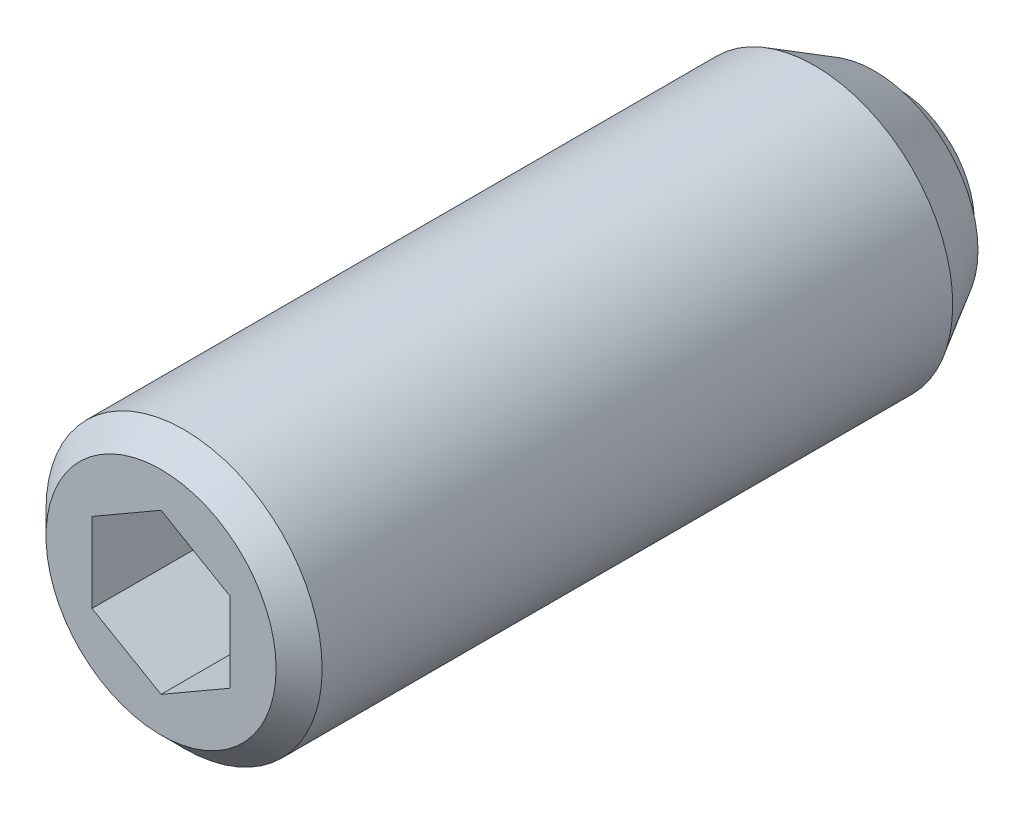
ISO-10303-21;
HEADER;
FILE_DESCRIPTION(('STEP AP214'),'2;1');
FILE_NAME('part.step','',(''),(''),'','','');
FILE_SCHEMA(('AUTOMOTIVE_DESIGN { 1 0 10303 214 1 1 1 1 }'));
ENDSEC;
DATA;
#1=APPLICATION_CONTEXT('core data for automotive mechanical design processes');
#2=APPLICATION_PROTOCOL_DEFINITION('international standard','automotive_design',2000,#1);
#3=PRODUCT_CONTEXT('',#1,'mechanical');
#4=PRODUCT('Part','Part','',(#3));
#5=PRODUCT_RELATED_PRODUCT_CATEGORY('part','',(#4));
#6=PRODUCT_DEFINITION_FORMATION('','',#4);
#7=PRODUCT_DEFINITION_CONTEXT('part definition',#1,'design');
#8=PRODUCT_DEFINITION('design','',#6,#7);
#9=PRODUCT_DEFINITION_SHAPE('','',#8);
#10=(LENGTH_UNIT() NAMED_UNIT(*) SI_UNIT(.MILLI.,.METRE.));
#11=(NAMED_UNIT(*) PLANE_ANGLE_UNIT() SI_UNIT($,.RADIAN.));
#12=(NAMED_UNIT(*) SI_UNIT($,.STERADIAN.) SOLID_ANGLE_UNIT());
#13=UNCERTAINTY_MEASURE_WITH_UNIT(LENGTH_MEASURE(1.E-05),#10,'distance_accuracy_value','');
#14=(GEOMETRIC_REPRESENTATION_CONTEXT(3) GLOBAL_UNCERTAINTY_ASSIGNED_CONTEXT((#13)) GLOBAL_UNIT_ASSIGNED_CONTEXT((#10,
#11,#12)) REPRESENTATION_CONTEXT('',''));
#15=CARTESIAN_POINT('',(0.,0.,0.));
#16=DIRECTION('',(0.,0.,1.));
#17=DIRECTION('',(1.,0.,0.));
#18=AXIS2_PLACEMENT_3D('',#15,#16,#17);
#19=CARTESIAN_POINT('',(1.5,0.866025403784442,13.5));
#20=DIRECTION('',(0.5,0.86602540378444,0.));
#21=DIRECTION('',(0.86602540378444,-0.5,0.));
#22=AXIS2_PLACEMENT_3D('',#19,#20,#21);
#23=PLANE('',#22);
#24=DIRECTION('',(0.,0.,1.));
#25=VECTOR('',#24,1.);
#26=CARTESIAN_POINT('',(1.5,0.866025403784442,13.5));
#27=LINE('',#26,#25);
#28=CARTESIAN_POINT('',(1.5,0.866025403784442,13.));
#29=VERTEX_POINT('',#28);
#30=CARTESIAN_POINT('',(1.5,0.866025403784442,16.));
#31=VERTEX_POINT('',#30);
#32=EDGE_CURVE('E68',#29,#31,#27,.T.);
#33=ORIENTED_EDGE('',*,*,#32,.T.);
#34=DIRECTION('',(-0.86602540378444,0.5,0.));
#35=VECTOR('',#34,1.);
#36=CARTESIAN_POINT('',(1.5,0.866025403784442,16.));
#37=LINE('',#36,#35);
#38=CARTESIAN_POINT('',(0.,1.73205080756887,16.));
#39=VERTEX_POINT('',#38);
#40=EDGE_CURVE('E29',#31,#39,#37,.T.);
#41=ORIENTED_EDGE('',*,*,#40,.T.);
#42=DIRECTION('',(0.,0.,1.));
#43=VECTOR('',#42,1.);
#44=CARTESIAN_POINT('',(0.,1.73205080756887,13.5));
#45=LINE('',#44,#43);
#46=CARTESIAN_POINT('',(0.,1.73205080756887,13.));
#47=VERTEX_POINT('',#46);
#48=EDGE_CURVE('E80',#47,#39,#45,.T.);
#49=ORIENTED_EDGE('',*,*,#48,.F.);
#50=DIRECTION('',(-0.86602540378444,0.5,0.));
#51=VECTOR('',#50,1.);
#52=CARTESIAN_POINT('',(1.5,0.866025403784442,13.));
#53=LINE('',#52,#51);
#54=EDGE_CURVE('E79',#29,#47,#53,.T.);
#55=ORIENTED_EDGE('',*,*,#54,.F.);
#56=EDGE_LOOP('',(#33,#41,#49,#55));
#57=FACE_BOUND('',#56,.T.);
#58=ADVANCED_FACE('F14',(#57),#23,.F.);
#59=CARTESIAN_POINT('',(1.5,-0.866025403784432,13.5));
#60=DIRECTION('',(1.,0.,0.));
#61=DIRECTION('',(0.,-1.,0.));
#62=AXIS2_PLACEMENT_3D('',#59,#60,#61);
#63=PLANE('',#62);
#64=DIRECTION('',(0.,0.,1.));
#65=VECTOR('',#64,1.);
#66=CARTESIAN_POINT('',(1.5,-0.866025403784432,13.5));
#67=LINE('',#66,#65);
#68=CARTESIAN_POINT('',(1.5,-0.866025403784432,13.));
#69=VERTEX_POINT('',#68);
#70=CARTESIAN_POINT('',(1.5,-0.866025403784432,16.));
#71=VERTEX_POINT('',#70);
#72=EDGE_CURVE('E76',#69,#71,#67,.T.);
#73=ORIENTED_EDGE('',*,*,#72,.T.);
#74=DIRECTION('',(0.,1.,0.));
#75=VECTOR('',#74,1.);
#76=CARTESIAN_POINT('',(1.5,-0.866025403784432,16.));
#77=LINE('',#76,#75);
#78=EDGE_CURVE('E75',#71,#31,#77,.T.);
#79=ORIENTED_EDGE('',*,*,#78,.T.);
#80=ORIENTED_EDGE('',*,*,#32,.F.);
#81=DIRECTION('',(0.,1.,0.));
#82=VECTOR('',#81,1.);
#83=CARTESIAN_POINT('',(1.5,-0.866025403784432,13.));
#84=LINE('',#83,#82);
#85=EDGE_CURVE('E72',#69,#29,#84,.T.);
#86=ORIENTED_EDGE('',*,*,#85,.F.);
#87=EDGE_LOOP('',(#73,#79,#80,#86));
#88=FACE_BOUND('',#87,.T.);
#89=ADVANCED_FACE('F70',(#88),#63,.F.);
#90=CARTESIAN_POINT('',(1.5,-0.866025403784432,13.5));
#91=DIRECTION('',(-0.5,0.866025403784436,0.));
#92=DIRECTION('',(0.866025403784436,0.5,0.));
#93=AXIS2_PLACEMENT_3D('',#90,#91,#92);
#94=PLANE('',#93);
#95=DIRECTION('',(0.,0.,1.));
#96=VECTOR('',#95,1.);
#97=CARTESIAN_POINT('',(0.,-1.73205080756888,13.5));
#98=LINE('',#97,#96);
#99=CARTESIAN_POINT('',(0.,-1.73205080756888,13.));
#100=VERTEX_POINT('',#99);
#101=CARTESIAN_POINT('',(0.,-1.73205080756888,16.));
#102=VERTEX_POINT('',#101);
#103=EDGE_CURVE('E122',#100,#102,#98,.T.);
#104=ORIENTED_EDGE('',*,*,#103,.T.);
#105=DIRECTION('',(-0.866025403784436,-0.5,0.));
#106=VECTOR('',#105,1.);
#107=CARTESIAN_POINT('',(1.5,-0.866025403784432,16.));
#108=LINE('',#107,#106);
#109=EDGE_CURVE('E113',#71,#102,#108,.T.);
#110=ORIENTED_EDGE('',*,*,#109,.F.);
#111=ORIENTED_EDGE('',*,*,#72,.F.);
#112=DIRECTION('',(0.866025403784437,0.5,0.));
#113=VECTOR('',#112,1.);
#114=CARTESIAN_POINT('',(0.,-1.73205080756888,13.));
#115=LINE('',#114,#113);
#116=EDGE_CURVE('E89',#100,#69,#115,.T.);
#117=ORIENTED_EDGE('',*,*,#116,.F.);
#118=EDGE_LOOP('',(#104,#110,#111,#117));
#119=FACE_BOUND('',#118,.T.);
#120=ADVANCED_FACE('F147',(#119),#94,.T.);
#121=CARTESIAN_POINT('',(-1.5,-0.866025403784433,13.5));
#122=DIRECTION('',(-0.5,-0.866025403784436,0.));
#123=DIRECTION('',(-0.866025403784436,0.5,0.));
#124=AXIS2_PLACEMENT_3D('',#121,#122,#123);
#125=PLANE('',#124);
#126=DIRECTION('',(0.,0.,1.));
#127=VECTOR('',#126,1.);
#128=CARTESIAN_POINT('',(-1.5,-0.866025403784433,13.5));
#129=LINE('',#128,#127);
#130=CARTESIAN_POINT('',(-1.5,-0.866025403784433,13.));
#131=VERTEX_POINT('',#130);
#132=CARTESIAN_POINT('',(-1.5,-0.866025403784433,16.));
#133=VERTEX_POINT('',#132);
#134=EDGE_CURVE('E120',#131,#133,#129,.T.);
#135=ORIENTED_EDGE('',*,*,#134,.T.);
#136=DIRECTION('',(0.866025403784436,-0.5,0.));
#137=VECTOR('',#136,1.);
#138=CARTESIAN_POINT('',(-1.5,-0.866025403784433,16.));
#139=LINE('',#138,#137);
#140=EDGE_CURVE('E111',#133,#102,#139,.T.);
#141=ORIENTED_EDGE('',*,*,#140,.T.);
#142=ORIENTED_EDGE('',*,*,#103,.F.);
#143=DIRECTION('',(0.866025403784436,-0.5,0.));
#144=VECTOR('',#143,1.);
#145=CARTESIAN_POINT('',(-1.5,-0.866025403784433,13.));
#146=LINE('',#145,#144);
#147=EDGE_CURVE('E101',#131,#100,#146,.T.);
#148=ORIENTED_EDGE('',*,*,#147,.F.);
#149=EDGE_LOOP('',(#135,#141,#142,#148));
#150=FACE_BOUND('',#149,.T.);
#151=ADVANCED_FACE('F157',(#150),#125,.F.);
#152=CARTESIAN_POINT('',(-1.5,-0.866025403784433,13.5));
#153=DIRECTION('',(1.,0.,0.));
#154=DIRECTION('',(0.,-1.,0.));
#155=AXIS2_PLACEMENT_3D('',#152,#153,#154);
#156=PLANE('',#155);
#157=DIRECTION('',(0.,0.,1.));
#158=VECTOR('',#157,1.);
#159=CARTESIAN_POINT('',(-1.5,0.866025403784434,13.5));
#160=LINE('',#159,#158);
#161=CARTESIAN_POINT('',(-1.5,0.866025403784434,13.));
#162=VERTEX_POINT('',#161);
#163=CARTESIAN_POINT('',(-1.5,0.866025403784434,16.));
#164=VERTEX_POINT('',#163);
#165=EDGE_CURVE('E37',#162,#164,#160,.T.);
#166=ORIENTED_EDGE('',*,*,#165,.T.);
#167=DIRECTION('',(0.,1.,0.));
#168=VECTOR('',#167,1.);
#169=CARTESIAN_POINT('',(-1.5,-0.866025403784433,16.));
#170=LINE('',#169,#168);
#171=EDGE_CURVE('E108',#133,#164,#170,.T.);
#172=ORIENTED_EDGE('',*,*,#171,.F.);
#173=ORIENTED_EDGE('',*,*,#134,.F.);
#174=DIRECTION('',(0.,-1.,0.));
#175=VECTOR('',#174,1.);
#176=CARTESIAN_POINT('',(-1.5,0.866025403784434,13.));
#177=LINE('',#176,#175);
#178=EDGE_CURVE('E98',#162,#131,#177,.T.);
#179=ORIENTED_EDGE('',*,*,#178,.F.);
#180=EDGE_LOOP('',(#166,#172,#173,#179));
#181=FACE_BOUND('',#180,.T.);
#182=ADVANCED_FACE('F153',(#181),#156,.T.);
#183=CARTESIAN_POINT('',(-1.5,0.866025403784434,13.5));
#184=DIRECTION('',(0.5,-0.866025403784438,0.));
#185=DIRECTION('',(-0.866025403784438,-0.5,0.));
#186=AXIS2_PLACEMENT_3D('',#183,#184,#185);
#187=PLANE('',#186);
#188=ORIENTED_EDGE('',*,*,#165,.F.);
#189=DIRECTION('',(-0.866025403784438,-0.5,0.));
#190=VECTOR('',#189,1.);
#191=CARTESIAN_POINT('',(0.,1.73205080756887,13.));
#192=LINE('',#191,#190);
#193=EDGE_CURVE('E84',#47,#162,#192,.T.);
#194=ORIENTED_EDGE('',*,*,#193,.F.);
#195=ORIENTED_EDGE('',*,*,#48,.T.);
#196=DIRECTION('',(0.866025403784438,0.5,0.));
#197=VECTOR('',#196,1.);
#198=CARTESIAN_POINT('',(-1.5,0.866025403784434,16.));
#199=LINE('',#198,#197);
#200=EDGE_CURVE('E105',#164,#39,#199,.T.);
#201=ORIENTED_EDGE('',*,*,#200,.F.);
#202=EDGE_LOOP('',(#188,#194,#195,#201));
#203=FACE_BOUND('',#202,.T.);
#204=ADVANCED_FACE('F150',(#203),#187,.T.);
#205=CARTESIAN_POINT('',(0.,0.,15.75));
#206=DIRECTION('',(0.,0.,-1.));
#207=DIRECTION('',(1.,0.,0.));
#208=AXIS2_PLACEMENT_3D('',#205,#206,#207);
#209=CYLINDRICAL_SURFACE('',#208,3.);
#210=CARTESIAN_POINT('',(0.,0.,15.5));
#211=DIRECTION('',(0.,0.,-1.));
#212=DIRECTION('',(1.,0.,0.));
#213=AXIS2_PLACEMENT_3D('',#210,#211,#212);
#214=CIRCLE('',#213,3.);
#215=CARTESIAN_POINT('',(3.,0.,15.5));
#216=VERTEX_POINT('',#215);
#217=EDGE_CURVE('E9',#216,#216,#214,.T.);
#218=ORIENTED_EDGE('',*,*,#217,.T.);
#219=EDGE_LOOP('',(#218));
#220=FACE_BOUND('',#219,.T.);
#221=CARTESIAN_POINT('',(0.,0.,1.79903810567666));
#222=DIRECTION('',(0.,0.,-1.));
#223=DIRECTION('',(-1.,0.,0.));
#224=AXIS2_PLACEMENT_3D('',#221,#222,#223);
#225=CIRCLE('',#224,3.);
#226=CARTESIAN_POINT('',(-3.,0.,1.79903810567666));
#227=VERTEX_POINT('',#226);
#228=EDGE_CURVE('E260',#227,#227,#225,.T.);
#229=ORIENTED_EDGE('',*,*,#228,.F.);
#230=EDGE_LOOP('',(#229));
#231=FACE_BOUND('',#230,.T.);
#232=ADVANCED_FACE('F16',(#220,#231),#209,.T.);
#233=CARTESIAN_POINT('',(0.,0.,15.5));
#234=DIRECTION('',(0.,0.,-1.));
#235=DIRECTION('',(1.,0.,0.));
#236=AXIS2_PLACEMENT_3D('',#233,#234,#235);
#237=CONICAL_SURFACE('',#236,3.,0.785398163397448);
#238=CARTESIAN_POINT('',(0.,0.,16.));
#239=DIRECTION('',(0.,0.,-1.));
#240=DIRECTION('',(1.,0.,0.));
#241=AXIS2_PLACEMENT_3D('',#238,#239,#240);
#242=CIRCLE('',#241,2.5);
#243=CARTESIAN_POINT('',(2.5,0.,16.));
#244=VERTEX_POINT('',#243);
#245=EDGE_CURVE('E22',#244,#244,#242,.T.);
#246=ORIENTED_EDGE('',*,*,#245,.T.);
#247=EDGE_LOOP('',(#246));
#248=FACE_BOUND('',#247,.T.);
#249=ORIENTED_EDGE('',*,*,#217,.F.);
#250=EDGE_LOOP('',(#249));
#251=FACE_BOUND('',#250,.T.);
#252=ADVANCED_FACE('F127',(#248,#251),#237,.T.);
#253=CARTESIAN_POINT('',(0.,0.,16.));
#254=DIRECTION('',(0.,0.,-1.));
#255=DIRECTION('',(1.,0.,0.));
#256=AXIS2_PLACEMENT_3D('',#253,#254,#255);
#257=PLANE('',#256);
#258=ORIENTED_EDGE('',*,*,#200,.T.);
#259=ORIENTED_EDGE('',*,*,#40,.F.);
#260=ORIENTED_EDGE('',*,*,#78,.F.);
#261=ORIENTED_EDGE('',*,*,#109,.T.);
#262=ORIENTED_EDGE('',*,*,#140,.F.);
#263=ORIENTED_EDGE('',*,*,#171,.T.);
#264=EDGE_LOOP('',(#258,#259,#260,#261,#262,#263));
#265=FACE_BOUND('',#264,.T.);
#266=ORIENTED_EDGE('',*,*,#245,.F.);
#267=EDGE_LOOP('',(#266));
#268=FACE_BOUND('',#267,.T.);
#269=ADVANCED_FACE('F130',(#265,#268),#257,.F.);
#270=CARTESIAN_POINT('',(1.5,0.866025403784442,13.));
#271=DIRECTION('',(0.,0.,1.));
#272=DIRECTION('',(1.,0.,0.));
#273=AXIS2_PLACEMENT_3D('',#270,#271,#272);
#274=PLANE('',#273);
#275=ORIENTED_EDGE('',*,*,#85,.T.);
#276=ORIENTED_EDGE('',*,*,#54,.T.);
#277=ORIENTED_EDGE('',*,*,#193,.T.);
#278=ORIENTED_EDGE('',*,*,#178,.T.);
#279=ORIENTED_EDGE('',*,*,#147,.T.);
#280=ORIENTED_EDGE('',*,*,#116,.T.);
#281=EDGE_LOOP('',(#275,#276,#277,#278,#279,#280));
#282=FACE_BOUND('',#281,.T.);
#283=ADVANCED_FACE('F86',(#282),#274,.T.);
#284=CARTESIAN_POINT('',(0.,0.,0.));
#285=DIRECTION('',(0.,0.,-1.));
#286=DIRECTION('',(-1.,0.,0.));
#287=AXIS2_PLACEMENT_3D('',#284,#285,#286);
#288=PLANE('',#287);
#289=CARTESIAN_POINT('',(0.,0.,0.));
#290=DIRECTION('',(0.,0.,-1.));
#291=DIRECTION('',(-1.,0.,0.));
#292=AXIS2_PLACEMENT_3D('',#289,#290,#291);
#293=CIRCLE('',#292,1.670329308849);
#294=CARTESIAN_POINT('',(-1.67032930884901,0.,0.));
#295=VERTEX_POINT('',#294);
#296=EDGE_CURVE('E90',#295,#295,#293,.T.);
#297=ORIENTED_EDGE('',*,*,#296,.T.);
#298=EDGE_LOOP('',(#297));
#299=FACE_BOUND('',#298,.T.);
#300=ADVANCED_FACE('F139',(#299),#288,.T.);
#301=CARTESIAN_POINT('',(0.,0.,1.1));
#302=DIRECTION('',(0.,0.,-1.));
#303=DIRECTION('',(-1.,0.,0.));
#304=AXIS2_PLACEMENT_3D('',#301,#302,#303);
#305=SPHERICAL_SURFACE('',#304,2.);
#306=CARTESIAN_POINT('',(0.,0.,0.5));
#307=DIRECTION('',(0.,0.,-1.));
#308=DIRECTION('',(-1.,0.,0.));
#309=AXIS2_PLACEMENT_3D('',#306,#307,#308);
#310=CIRCLE('',#309,1.90787840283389);
#311=CARTESIAN_POINT('',(-1.90787840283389,0.,0.5));
#312=VERTEX_POINT('',#311);
#313=EDGE_CURVE('E93',#312,#312,#310,.T.);
#314=CARTESIAN_POINT('',(-1.90787840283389,0.,0.5));
#315=CARTESIAN_POINT('',(-1.90614295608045,0.,0.494481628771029));
#316=CARTESIAN_POINT('',(-1.90438356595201,0.,0.488970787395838));
#317=CARTESIAN_POINT('',(-1.90081703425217,0.,0.477964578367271));
#318=CARTESIAN_POINT('',(-1.89900989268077,0.,0.472469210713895));
#319=CARTESIAN_POINT('',(-1.8953479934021,0.,0.46149436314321));
#320=CARTESIAN_POINT('',(-1.89349323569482,0.,0.456014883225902));
#321=CARTESIAN_POINT('',(-1.88973624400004,0.,0.445072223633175));
#322=CARTESIAN_POINT('',(-1.88783401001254,0.,0.439609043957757));
#323=CARTESIAN_POINT('',(-1.88398220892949,0.,0.428699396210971));
#324=CARTESIAN_POINT('',(-1.88203264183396,0.,0.423252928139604));
#325=CARTESIAN_POINT('',(-1.87808632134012,0.,0.412377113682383));
#326=CARTESIAN_POINT('',(-1.87608956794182,0.,0.40694776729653));
#327=CARTESIAN_POINT('',(-1.87204902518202,0.,0.396106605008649));
#328=CARTESIAN_POINT('',(-1.87000523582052,0.,0.39069478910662));
#329=CARTESIAN_POINT('',(-1.86587077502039,0.,0.379889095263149));
#330=CARTESIAN_POINT('',(-1.86378010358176,0.,0.374495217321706));
#331=CARTESIAN_POINT('',(-1.85955203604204,0.,0.363725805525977));
#332=CARTESIAN_POINT('',(-1.85741463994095,0.,0.358350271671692));
#333=CARTESIAN_POINT('',(-1.85309328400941,0.,0.347617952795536));
#334=CARTESIAN_POINT('',(-1.85090932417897,0.,0.342261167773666));
#335=CARTESIAN_POINT('',(-1.84649500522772,0.,0.331566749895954));
#336=CARTESIAN_POINT('',(-1.84426464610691,0.,0.326229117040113));
#337=CARTESIAN_POINT('',(-1.83975769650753,0.,0.315573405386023));
#338=CARTESIAN_POINT('',(-1.83748110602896,0.,0.310255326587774));
#339=CARTESIAN_POINT('',(-1.83288186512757,0.,0.299639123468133));
#340=CARTESIAN_POINT('',(-1.83055921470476,0.,0.29434099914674));
#341=CARTESIAN_POINT('',(-1.82586802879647,0.,0.283765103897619));
#342=CARTESIAN_POINT('',(-1.823499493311,0.,0.278487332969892));
#343=CARTESIAN_POINT('',(-1.81871671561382,0.,0.267952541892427));
#344=CARTESIAN_POINT('',(-1.81630247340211,0.,0.26269552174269));
#345=CARTESIAN_POINT('',(-1.81142846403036,0.,0.252202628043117));
#346=CARTESIAN_POINT('',(-1.80896869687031,0.,0.246966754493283));
#347=CARTESIAN_POINT('',(-1.80400382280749,0.,0.236516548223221));
#348=CARTESIAN_POINT('',(-1.80149871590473,0.,0.231302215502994));
#349=CARTESIAN_POINT('',(-1.79644335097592,0.,0.220895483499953));
#350=CARTESIAN_POINT('',(-1.79389309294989,0.,0.215703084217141));
#351=CARTESIAN_POINT('',(-1.78874761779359,0.,0.205340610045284));
#352=CARTESIAN_POINT('',(-1.78615240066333,0.,0.200170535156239));
#353=CARTESIAN_POINT('',(-1.78091720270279,0.,0.189853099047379));
#354=CARTESIAN_POINT('',(-1.77827722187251,0.,0.184705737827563));
#355=CARTESIAN_POINT('',(-1.77295269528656,0.,0.174434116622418));
#356=CARTESIAN_POINT('',(-1.77026814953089,0.,0.169309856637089));
#357=CARTESIAN_POINT('',(-1.76485469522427,0.,0.159084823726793));
#358=CARTESIAN_POINT('',(-1.76212578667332,0.,0.153984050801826));
#359=CARTESIAN_POINT('',(-1.7566238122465,0.,0.143806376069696));
#360=CARTESIAN_POINT('',(-1.75385074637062,0.,0.138729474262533));
#361=CARTESIAN_POINT('',(-1.7482606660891,0.,0.128599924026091));
#362=CARTESIAN_POINT('',(-1.74544365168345,0.,0.123547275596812));
#363=CARTESIAN_POINT('',(-1.73976588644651,0.,0.113466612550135));
#364=CARTESIAN_POINT('',(-1.73690513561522,0.,0.108438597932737));
#365=CARTESIAN_POINT('',(-1.73114011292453,0.,0.0984075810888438));
#366=CARTESIAN_POINT('',(-1.72823584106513,0.,0.0934045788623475));
#367=CARTESIAN_POINT('',(-1.72238399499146,0.,0.0834239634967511));
#368=CARTESIAN_POINT('',(-1.71943642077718,0.,0.078446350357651));
#369=CARTESIAN_POINT('',(-1.71349819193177,0.,0.0685168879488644));
#370=CARTESIAN_POINT('',(-1.71050753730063,0.,0.0635650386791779));
#371=CARTESIAN_POINT('',(-1.70448337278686,0.,0.0536874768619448));
#372=CARTESIAN_POINT('',(-1.70144986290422,0.,0.0487617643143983));
#373=CARTESIAN_POINT('',(-1.6953402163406,0.,0.0389368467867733));
#374=CARTESIAN_POINT('',(-1.69226407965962,0.,0.034037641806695));
#375=CARTESIAN_POINT('',(-1.68606941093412,0.,0.0242661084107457));
#376=CARTESIAN_POINT('',(-1.68295087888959,0.,0.0193937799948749));
#377=CARTESIAN_POINT('',(-1.67667165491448,0.,0.00967636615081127));
#378=CARTESIAN_POINT('',(-1.67351096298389,0.,0.00483128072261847));
#379=CARTESIAN_POINT('',(-1.67032930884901,0.,0.));
#380=B_SPLINE_CURVE_WITH_KNOTS('',3,(#314,#315,#316,#317,#318,#319,#320,#321,#322,#323,#324,
#325,#326,#327,#328,#329,#330,#331,#332,#333,#334,#335,#336,#337,#338,#339,#340,#341,#342,#343,
#344,#345,#346,#347,#348,#349,#350,#351,#352,#353,#354,#355,#356,#357,#358,#359,#360,#361,#362,
#363,#364,#365,#366,#367,#368,#369,#370,#371,#372,#373,#374,#375,#376,#377,#378,#379),
.UNSPECIFIED.,.F.,.F.,(4,2,2,2,2,2,2,2,2,2,2,2,2,2,2,2,2,2,2,2,2,2,2,2,2,2,2,2,2,2,2,2,4),(0.,
0.0173544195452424,0.0347088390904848,0.0520632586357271,0.0694176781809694,0.0867720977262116,
0.104126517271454,0.121480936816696,0.138835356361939,0.156189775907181,0.173544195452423,
0.190898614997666,0.208253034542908,0.22560745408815,0.242961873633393,0.260316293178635,
0.277670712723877,0.295025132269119,0.312379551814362,0.329733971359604,0.347088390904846,
0.364442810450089,0.381797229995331,0.399151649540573,0.416506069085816,0.433860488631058,
0.4512149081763,0.468569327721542,0.485923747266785,0.503278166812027,0.52063258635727,
0.537987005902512,0.555341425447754),.UNSPECIFIED.);
#381=EDGE_CURVE('BSEAM223',#312,#295,#380,.T.);
#382=ORIENTED_EDGE('',*,*,#313,.T.);
#383=ORIENTED_EDGE('',*,*,#296,.F.);
#384=ORIENTED_EDGE('',*,*,#381,.T.);
#385=ORIENTED_EDGE('',*,*,#381,.F.);
#386=EDGE_LOOP('',(#382,#384,#383,#385));
#387=FACE_BOUND('',#386,.T.);
#388=ADVANCED_FACE('F223',(#387),#305,.T.);
#389=CARTESIAN_POINT('',(-1.90787840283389,0.,0.5));
#390=DIRECTION('',(0.,0.,-1.));
#391=DIRECTION('',(-1.,0.,0.));
#392=AXIS2_PLACEMENT_3D('',#389,#390,#391);
#393=PLANE('',#392);
#394=CARTESIAN_POINT('',(0.,0.,0.5));
#395=DIRECTION('',(0.,0.,-1.));
#396=DIRECTION('',(-1.,0.,0.));
#397=AXIS2_PLACEMENT_3D('',#394,#395,#396);
#398=CIRCLE('',#397,2.25);
#399=CARTESIAN_POINT('',(-2.25,0.,0.5));
#400=VERTEX_POINT('',#399);
#401=EDGE_CURVE('E263',#400,#400,#398,.T.);
#402=ORIENTED_EDGE('',*,*,#401,.T.);
#403=EDGE_LOOP('',(#402));
#404=FACE_BOUND('',#403,.T.);
#405=ORIENTED_EDGE('',*,*,#313,.F.);
#406=EDGE_LOOP('',(#405));
#407=FACE_BOUND('',#406,.T.);
#408=ADVANCED_FACE('F232',(#404,#407),#393,.T.);
#409=CARTESIAN_POINT('',(0.,0.,0.5));
#410=DIRECTION('',(0.,0.,1.));
#411=DIRECTION('',(1.,0.,0.));
#412=AXIS2_PLACEMENT_3D('',#409,#410,#411);
#413=CONICAL_SURFACE('',#412,2.25,0.523598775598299);
#414=ORIENTED_EDGE('',*,*,#228,.T.);
#415=EDGE_LOOP('',(#414));
#416=FACE_BOUND('',#415,.T.);
#417=ORIENTED_EDGE('',*,*,#401,.F.);
#418=EDGE_LOOP('',(#417));
#419=FACE_BOUND('',#418,.T.);
#420=ADVANCED_FACE('F242',(#416,#419),#413,.T.);
#421=CLOSED_SHELL('',(#58,#89,#120,#151,#182,#204,#232,#252,#269,#283,#300,#388,#408,#420));
#422=MANIFOLD_SOLID_BREP('B1',#421);
#423=ADVANCED_BREP_SHAPE_REPRESENTATION('',(#18,#422),#14);
#424=SHAPE_DEFINITION_REPRESENTATION(#9,#423);
ENDSEC;
END-ISO-10303-21;
